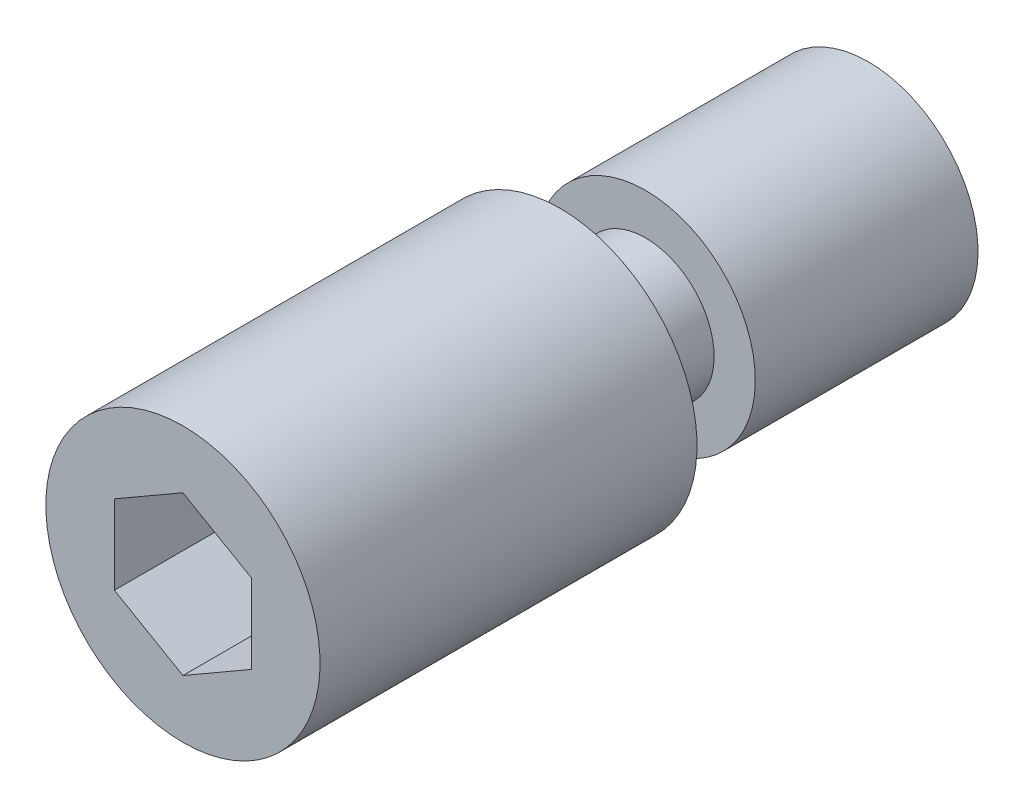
ISO-10303-21;
HEADER;
FILE_DESCRIPTION(('STEP AP214'),'2;1');
FILE_NAME('part.step','',(''),(''),'','','');
FILE_SCHEMA(('AUTOMOTIVE_DESIGN { 1 0 10303 214 1 1 1 1 }'));
ENDSEC;
DATA;
#1=APPLICATION_CONTEXT('core data for automotive mechanical design processes');
#2=APPLICATION_PROTOCOL_DEFINITION('international standard','automotive_design',2000,#1);
#3=PRODUCT_CONTEXT('',#1,'mechanical');
#4=PRODUCT('Part','Part','',(#3));
#5=PRODUCT_RELATED_PRODUCT_CATEGORY('part','',(#4));
#6=PRODUCT_DEFINITION_FORMATION('','',#4);
#7=PRODUCT_DEFINITION_CONTEXT('part definition',#1,'design');
#8=PRODUCT_DEFINITION('design','',#6,#7);
#9=PRODUCT_DEFINITION_SHAPE('','',#8);
#10=(LENGTH_UNIT() NAMED_UNIT(*) SI_UNIT(.MILLI.,.METRE.));
#11=(NAMED_UNIT(*) PLANE_ANGLE_UNIT() SI_UNIT($,.RADIAN.));
#12=(NAMED_UNIT(*) SI_UNIT($,.STERADIAN.) SOLID_ANGLE_UNIT());
#13=UNCERTAINTY_MEASURE_WITH_UNIT(LENGTH_MEASURE(1.E-05),#10,'distance_accuracy_value','');
#14=(GEOMETRIC_REPRESENTATION_CONTEXT(3) GLOBAL_UNCERTAINTY_ASSIGNED_CONTEXT((#13)) GLOBAL_UNIT_ASSIGNED_CONTEXT((#10,
#11,#12)) REPRESENTATION_CONTEXT('',''));
#15=CARTESIAN_POINT('',(0.,0.,0.));
#16=DIRECTION('',(0.,0.,1.));
#17=DIRECTION('',(1.,0.,0.));
#18=AXIS2_PLACEMENT_3D('',#15,#16,#17);
#19=CARTESIAN_POINT('',(0.,-4.,9.));
#20=DIRECTION('',(0.,0.,-1.));
#21=DIRECTION('',(0.,-1.,0.));
#22=AXIS2_PLACEMENT_3D('',#19,#20,#21);
#23=PLANE('',#22);
#24=CARTESIAN_POINT('',(0.,0.,9.));
#25=DIRECTION('',(0.,0.,1.));
#26=DIRECTION('',(0.,1.,0.));
#27=AXIS2_PLACEMENT_3D('',#24,#25,#26);
#28=CIRCLE('',#27,2.);
#29=CARTESIAN_POINT('',(0.,2.,9.));
#30=VERTEX_POINT('',#29);
#31=EDGE_CURVE('E83',#30,#30,#28,.T.);
#32=ORIENTED_EDGE('',*,*,#31,.T.);
#33=EDGE_LOOP('',(#32));
#34=FACE_BOUND('',#33,.T.);
#35=CARTESIAN_POINT('',(0.,0.,9.));
#36=DIRECTION('',(0.,0.,1.));
#37=DIRECTION('',(0.,1.,0.));
#38=AXIS2_PLACEMENT_3D('',#35,#36,#37);
#39=CIRCLE('',#38,4.);
#40=CARTESIAN_POINT('',(0.,4.,9.));
#41=VERTEX_POINT('',#40);
#42=EDGE_CURVE('E9',#41,#41,#39,.T.);
#43=ORIENTED_EDGE('',*,*,#42,.F.);
#44=EDGE_LOOP('',(#43));
#45=FACE_BOUND('',#44,.T.);
#46=ADVANCED_FACE('F14',(#34,#45),#23,.T.);
#47=CARTESIAN_POINT('',(0.,0.,20.));
#48=DIRECTION('',(0.,0.,1.));
#49=DIRECTION('',(0.,1.,0.));
#50=AXIS2_PLACEMENT_3D('',#47,#48,#49);
#51=CYLINDRICAL_SURFACE('',#50,4.);
#52=CARTESIAN_POINT('',(0.,0.,20.));
#53=DIRECTION('',(0.,0.,1.));
#54=DIRECTION('',(0.,1.,0.));
#55=AXIS2_PLACEMENT_3D('',#52,#53,#54);
#56=CIRCLE('',#55,4.);
#57=CARTESIAN_POINT('',(0.,4.,20.));
#58=VERTEX_POINT('',#57);
#59=EDGE_CURVE('E21',#58,#58,#56,.T.);
#60=ORIENTED_EDGE('',*,*,#59,.F.);
#61=EDGE_LOOP('',(#60));
#62=FACE_BOUND('',#61,.T.);
#63=ORIENTED_EDGE('',*,*,#42,.T.);
#64=EDGE_LOOP('',(#63));
#65=FACE_BOUND('',#64,.T.);
#66=ADVANCED_FACE('F112',(#62,#65),#51,.T.);
#67=CARTESIAN_POINT('',(0.,-4.,20.));
#68=DIRECTION('',(0.,0.,-1.));
#69=DIRECTION('',(0.,-1.,0.));
#70=AXIS2_PLACEMENT_3D('',#67,#68,#69);
#71=PLANE('',#70);
#72=DIRECTION('',(-0.866025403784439,-0.5,0.));
#73=VECTOR('',#72,1.);
#74=CARTESIAN_POINT('',(0.,2.30940107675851,20.));
#75=LINE('',#74,#73);
#76=CARTESIAN_POINT('',(0.,2.30940107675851,20.));
#77=VERTEX_POINT('',#76);
#78=CARTESIAN_POINT('',(-2.,1.15470053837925,20.));
#79=VERTEX_POINT('',#78);
#80=EDGE_CURVE('E152',#77,#79,#75,.T.);
#81=ORIENTED_EDGE('',*,*,#80,.F.);
#82=DIRECTION('',(-0.866025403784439,0.5,0.));
#83=VECTOR('',#82,1.);
#84=CARTESIAN_POINT('',(2.,1.15470053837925,20.));
#85=LINE('',#84,#83);
#86=CARTESIAN_POINT('',(2.,1.15470053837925,20.));
#87=VERTEX_POINT('',#86);
#88=EDGE_CURVE('E153',#87,#77,#85,.T.);
#89=ORIENTED_EDGE('',*,*,#88,.F.);
#90=DIRECTION('',(0.,1.,0.));
#91=VECTOR('',#90,1.);
#92=CARTESIAN_POINT('',(2.,-1.15470053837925,20.));
#93=LINE('',#92,#91);
#94=CARTESIAN_POINT('',(2.,-1.15470053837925,20.));
#95=VERTEX_POINT('',#94);
#96=EDGE_CURVE('E81',#95,#87,#93,.T.);
#97=ORIENTED_EDGE('',*,*,#96,.F.);
#98=DIRECTION('',(0.866025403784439,0.5,0.));
#99=VECTOR('',#98,1.);
#100=CARTESIAN_POINT('',(0.,-2.30940107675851,20.));
#101=LINE('',#100,#99);
#102=CARTESIAN_POINT('',(0.,-2.30940107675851,20.));
#103=VERTEX_POINT('',#102);
#104=EDGE_CURVE('E165',#103,#95,#101,.T.);
#105=ORIENTED_EDGE('',*,*,#104,.F.);
#106=DIRECTION('',(0.866025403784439,-0.5,0.));
#107=VECTOR('',#106,1.);
#108=CARTESIAN_POINT('',(-2.,-1.15470053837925,20.));
#109=LINE('',#108,#107);
#110=CARTESIAN_POINT('',(-2.,-1.15470053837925,20.));
#111=VERTEX_POINT('',#110);
#112=EDGE_CURVE('E159',#111,#103,#109,.T.);
#113=ORIENTED_EDGE('',*,*,#112,.F.);
#114=DIRECTION('',(0.,-1.,0.));
#115=VECTOR('',#114,1.);
#116=CARTESIAN_POINT('',(-2.,1.15470053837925,20.));
#117=LINE('',#116,#115);
#118=EDGE_CURVE('E156',#79,#111,#117,.T.);
#119=ORIENTED_EDGE('',*,*,#118,.F.);
#120=EDGE_LOOP('',(#81,#89,#97,#105,#113,#119));
#121=FACE_BOUND('',#120,.T.);
#122=ORIENTED_EDGE('',*,*,#59,.T.);
#123=EDGE_LOOP('',(#122));
#124=FACE_BOUND('',#123,.T.);
#125=ADVANCED_FACE('F110',(#121,#124),#71,.F.);
#126=CARTESIAN_POINT('',(0.,-3.2,0.));
#127=DIRECTION('',(0.,0.,-1.));
#128=DIRECTION('',(0.,-1.,0.));
#129=AXIS2_PLACEMENT_3D('',#126,#127,#128);
#130=PLANE('',#129);
#131=CARTESIAN_POINT('',(0.,0.,0.));
#132=DIRECTION('',(0.,0.,1.));
#133=DIRECTION('',(0.,1.,0.));
#134=AXIS2_PLACEMENT_3D('',#131,#132,#133);
#135=CIRCLE('',#134,3.2);
#136=CARTESIAN_POINT('',(0.,3.2,0.));
#137=VERTEX_POINT('',#136);
#138=EDGE_CURVE('E105',#137,#137,#135,.T.);
#139=ORIENTED_EDGE('',*,*,#138,.F.);
#140=EDGE_LOOP('',(#139));
#141=FACE_BOUND('',#140,.T.);
#142=ADVANCED_FACE('F141',(#141),#130,.T.);
#143=CARTESIAN_POINT('',(0.,0.,20.));
#144=DIRECTION('',(0.,0.,1.));
#145=DIRECTION('',(0.,1.,0.));
#146=AXIS2_PLACEMENT_3D('',#143,#144,#145);
#147=CYLINDRICAL_SURFACE('',#146,3.2);
#148=ORIENTED_EDGE('',*,*,#138,.T.);
#149=EDGE_LOOP('',(#148));
#150=FACE_BOUND('',#149,.T.);
#151=CARTESIAN_POINT('',(0.,0.,6.5));
#152=DIRECTION('',(0.,0.,1.));
#153=DIRECTION('',(0.,1.,0.));
#154=AXIS2_PLACEMENT_3D('',#151,#152,#153);
#155=CIRCLE('',#154,3.2);
#156=CARTESIAN_POINT('',(0.,3.2,6.5));
#157=VERTEX_POINT('',#156);
#158=EDGE_CURVE('E102',#157,#157,#155,.T.);
#159=ORIENTED_EDGE('',*,*,#158,.F.);
#160=EDGE_LOOP('',(#159));
#161=FACE_BOUND('',#160,.T.);
#162=ADVANCED_FACE('F134',(#150,#161),#147,.T.);
#163=CARTESIAN_POINT('',(0.,-2.,6.5));
#164=DIRECTION('',(0.,0.,1.));
#165=DIRECTION('',(0.,1.,0.));
#166=AXIS2_PLACEMENT_3D('',#163,#164,#165);
#167=PLANE('',#166);
#168=ORIENTED_EDGE('',*,*,#158,.T.);
#169=EDGE_LOOP('',(#168));
#170=FACE_BOUND('',#169,.T.);
#171=CARTESIAN_POINT('',(0.,0.,6.5));
#172=DIRECTION('',(0.,0.,1.));
#173=DIRECTION('',(0.,1.,0.));
#174=AXIS2_PLACEMENT_3D('',#171,#172,#173);
#175=CIRCLE('',#174,2.);
#176=CARTESIAN_POINT('',(0.,2.,6.5));
#177=VERTEX_POINT('',#176);
#178=EDGE_CURVE('E87',#177,#177,#175,.T.);
#179=ORIENTED_EDGE('',*,*,#178,.F.);
#180=EDGE_LOOP('',(#179));
#181=FACE_BOUND('',#180,.T.);
#182=ADVANCED_FACE('F126',(#170,#181),#167,.T.);
#183=CARTESIAN_POINT('',(0.,0.,20.));
#184=DIRECTION('',(0.,0.,1.));
#185=DIRECTION('',(0.,1.,0.));
#186=AXIS2_PLACEMENT_3D('',#183,#184,#185);
#187=CYLINDRICAL_SURFACE('',#186,2.);
#188=ORIENTED_EDGE('',*,*,#178,.T.);
#189=EDGE_LOOP('',(#188));
#190=FACE_BOUND('',#189,.T.);
#191=ORIENTED_EDGE('',*,*,#31,.F.);
#192=EDGE_LOOP('',(#191));
#193=FACE_BOUND('',#192,.T.);
#194=ADVANCED_FACE('F124',(#190,#193),#187,.T.);
#195=CARTESIAN_POINT('',(2.,1.15470053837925,14.));
#196=DIRECTION('',(0.5,0.866025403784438,0.));
#197=DIRECTION('',(-0.866025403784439,0.5,0.));
#198=AXIS2_PLACEMENT_3D('',#195,#196,#197);
#199=PLANE('',#198);
#200=DIRECTION('',(0.,0.,1.));
#201=VECTOR('',#200,1.);
#202=CARTESIAN_POINT('',(0.,2.30940107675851,14.));
#203=LINE('',#202,#201);
#204=CARTESIAN_POINT('',(0.,2.30940107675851,15.));
#205=VERTEX_POINT('',#204);
#206=EDGE_CURVE('E35',#205,#77,#203,.T.);
#207=ORIENTED_EDGE('',*,*,#206,.F.);
#208=DIRECTION('',(-0.866025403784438,0.5,0.));
#209=VECTOR('',#208,1.);
#210=CARTESIAN_POINT('',(2.,1.15470053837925,15.));
#211=LINE('',#210,#209);
#212=CARTESIAN_POINT('',(2.,1.15470053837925,15.));
#213=VERTEX_POINT('',#212);
#214=EDGE_CURVE('E28',#213,#205,#211,.T.);
#215=ORIENTED_EDGE('',*,*,#214,.F.);
#216=DIRECTION('',(0.,0.,1.));
#217=VECTOR('',#216,1.);
#218=CARTESIAN_POINT('',(2.,1.15470053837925,14.));
#219=LINE('',#218,#217);
#220=EDGE_CURVE('E75',#213,#87,#219,.T.);
#221=ORIENTED_EDGE('',*,*,#220,.T.);
#222=ORIENTED_EDGE('',*,*,#88,.T.);
#223=EDGE_LOOP('',(#207,#215,#221,#222));
#224=FACE_BOUND('',#223,.T.);
#225=ADVANCED_FACE('F74',(#224),#199,.F.);
#226=CARTESIAN_POINT('',(2.,-1.15470053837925,14.));
#227=DIRECTION('',(1.,0.,0.));
#228=DIRECTION('',(0.,0.,-1.));
#229=AXIS2_PLACEMENT_3D('',#226,#227,#228);
#230=PLANE('',#229);
#231=ORIENTED_EDGE('',*,*,#220,.F.);
#232=DIRECTION('',(0.,1.,0.));
#233=VECTOR('',#232,1.);
#234=CARTESIAN_POINT('',(2.,-1.15470053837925,15.));
#235=LINE('',#234,#233);
#236=CARTESIAN_POINT('',(2.,-1.15470053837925,15.));
#237=VERTEX_POINT('',#236);
#238=EDGE_CURVE('E65',#237,#213,#235,.T.);
#239=ORIENTED_EDGE('',*,*,#238,.F.);
#240=DIRECTION('',(0.,0.,1.));
#241=VECTOR('',#240,1.);
#242=CARTESIAN_POINT('',(2.,-1.15470053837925,14.));
#243=LINE('',#242,#241);
#244=EDGE_CURVE('E84',#237,#95,#243,.T.);
#245=ORIENTED_EDGE('',*,*,#244,.T.);
#246=ORIENTED_EDGE('',*,*,#96,.T.);
#247=EDGE_LOOP('',(#231,#239,#245,#246));
#248=FACE_BOUND('',#247,.T.);
#249=ADVANCED_FACE('F79',(#248),#230,.F.);
#250=CARTESIAN_POINT('',(0.,-2.30940107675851,14.));
#251=DIRECTION('',(0.5,-0.866025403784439,0.));
#252=DIRECTION('',(0.866025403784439,0.5,0.));
#253=AXIS2_PLACEMENT_3D('',#250,#251,#252);
#254=PLANE('',#253);
#255=ORIENTED_EDGE('',*,*,#244,.F.);
#256=DIRECTION('',(0.866025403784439,0.5,0.));
#257=VECTOR('',#256,1.);
#258=CARTESIAN_POINT('',(0.,-2.30940107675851,15.));
#259=LINE('',#258,#257);
#260=CARTESIAN_POINT('',(0.,-2.30940107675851,15.));
#261=VERTEX_POINT('',#260);
#262=EDGE_CURVE('E68',#261,#237,#259,.T.);
#263=ORIENTED_EDGE('',*,*,#262,.F.);
#264=DIRECTION('',(0.,0.,1.));
#265=VECTOR('',#264,1.);
#266=CARTESIAN_POINT('',(0.,-2.30940107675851,14.));
#267=LINE('',#266,#265);
#268=EDGE_CURVE('E89',#261,#103,#267,.T.);
#269=ORIENTED_EDGE('',*,*,#268,.T.);
#270=ORIENTED_EDGE('',*,*,#104,.T.);
#271=EDGE_LOOP('',(#255,#263,#269,#270));
#272=FACE_BOUND('',#271,.T.);
#273=ADVANCED_FACE('F169',(#272),#254,.F.);
#274=CARTESIAN_POINT('',(-2.,-1.15470053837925,14.));
#275=DIRECTION('',(-0.5,-0.866025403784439,0.));
#276=DIRECTION('',(0.866025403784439,-0.5,0.));
#277=AXIS2_PLACEMENT_3D('',#274,#275,#276);
#278=PLANE('',#277);
#279=ORIENTED_EDGE('',*,*,#268,.F.);
#280=DIRECTION('',(0.866025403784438,-0.5,0.));
#281=VECTOR('',#280,1.);
#282=CARTESIAN_POINT('',(-2.,-1.15470053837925,15.));
#283=LINE('',#282,#281);
#284=CARTESIAN_POINT('',(-2.,-1.15470053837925,15.));
#285=VERTEX_POINT('',#284);
#286=EDGE_CURVE('E175',#285,#261,#283,.T.);
#287=ORIENTED_EDGE('',*,*,#286,.F.);
#288=DIRECTION('',(0.,0.,1.));
#289=VECTOR('',#288,1.);
#290=CARTESIAN_POINT('',(-2.,-1.15470053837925,14.));
#291=LINE('',#290,#289);
#292=EDGE_CURVE('E95',#285,#111,#291,.T.);
#293=ORIENTED_EDGE('',*,*,#292,.T.);
#294=ORIENTED_EDGE('',*,*,#112,.T.);
#295=EDGE_LOOP('',(#279,#287,#293,#294));
#296=FACE_BOUND('',#295,.T.);
#297=ADVANCED_FACE('F172',(#296),#278,.F.);
#298=CARTESIAN_POINT('',(-2.,1.15470053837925,14.));
#299=DIRECTION('',(-1.,0.,0.));
#300=DIRECTION('',(0.,-1.,0.));
#301=AXIS2_PLACEMENT_3D('',#298,#299,#300);
#302=PLANE('',#301);
#303=ORIENTED_EDGE('',*,*,#292,.F.);
#304=DIRECTION('',(0.,-1.,0.));
#305=VECTOR('',#304,1.);
#306=CARTESIAN_POINT('',(-2.,1.15470053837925,15.));
#307=LINE('',#306,#305);
#308=CARTESIAN_POINT('',(-2.,1.15470053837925,15.));
#309=VERTEX_POINT('',#308);
#310=EDGE_CURVE('E179',#309,#285,#307,.T.);
#311=ORIENTED_EDGE('',*,*,#310,.F.);
#312=DIRECTION('',(0.,0.,1.));
#313=VECTOR('',#312,1.);
#314=CARTESIAN_POINT('',(-2.,1.15470053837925,14.));
#315=LINE('',#314,#313);
#316=EDGE_CURVE('E97',#309,#79,#315,.T.);
#317=ORIENTED_EDGE('',*,*,#316,.T.);
#318=ORIENTED_EDGE('',*,*,#118,.T.);
#319=EDGE_LOOP('',(#303,#311,#317,#318));
#320=FACE_BOUND('',#319,.T.);
#321=ADVANCED_FACE('F178',(#320),#302,.F.);
#322=CARTESIAN_POINT('',(0.,2.30940107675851,14.));
#323=DIRECTION('',(-0.5,0.866025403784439,0.));
#324=DIRECTION('',(-0.866025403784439,-0.5,0.));
#325=AXIS2_PLACEMENT_3D('',#322,#323,#324);
#326=PLANE('',#325);
#327=ORIENTED_EDGE('',*,*,#316,.F.);
#328=DIRECTION('',(-0.866025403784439,-0.5,0.));
#329=VECTOR('',#328,1.);
#330=CARTESIAN_POINT('',(0.,2.30940107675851,15.));
#331=LINE('',#330,#329);
#332=EDGE_CURVE('E77',#205,#309,#331,.T.);
#333=ORIENTED_EDGE('',*,*,#332,.F.);
#334=ORIENTED_EDGE('',*,*,#206,.T.);
#335=ORIENTED_EDGE('',*,*,#80,.T.);
#336=EDGE_LOOP('',(#327,#333,#334,#335));
#337=FACE_BOUND('',#336,.T.);
#338=ADVANCED_FACE('F180',(#337),#326,.F.);
#339=CARTESIAN_POINT('',(2.,1.15470053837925,15.));
#340=DIRECTION('',(0.,0.,1.));
#341=DIRECTION('',(1.,0.,0.));
#342=AXIS2_PLACEMENT_3D('',#339,#340,#341);
#343=PLANE('',#342);
#344=ORIENTED_EDGE('',*,*,#238,.T.);
#345=ORIENTED_EDGE('',*,*,#214,.T.);
#346=ORIENTED_EDGE('',*,*,#332,.T.);
#347=ORIENTED_EDGE('',*,*,#310,.T.);
#348=ORIENTED_EDGE('',*,*,#286,.T.);
#349=ORIENTED_EDGE('',*,*,#262,.T.);
#350=EDGE_LOOP('',(#344,#345,#346,#347,#348,#349));
#351=FACE_BOUND('',#350,.T.);
#352=ADVANCED_FACE('F66',(#351),#343,.T.);
#353=CLOSED_SHELL('',(#46,#66,#125,#142,#162,#182,#194,#225,#249,#273,#297,#321,#338,#352));
#354=MANIFOLD_SOLID_BREP('B1',#353);
#355=ADVANCED_BREP_SHAPE_REPRESENTATION('',(#18,#354),#14);
#356=SHAPE_DEFINITION_REPRESENTATION(#9,#355);
ENDSEC;
END-ISO-10303-21;
